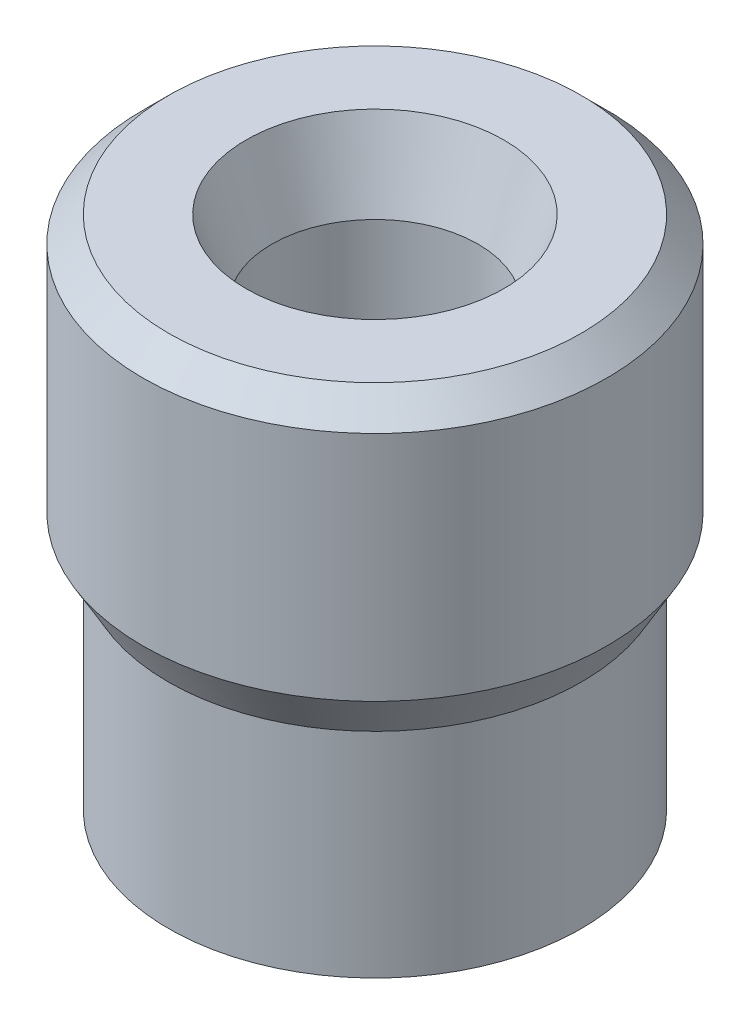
from build123d import *

# Parameters (mm, degrees)
SKICA1_R                 = 8
P_IDAT_VYSUNUT_M1_DEPTH  = 8.3
SKICA2_R                 = 9
P_IDAT_VYSUNUT_M2_DEPTH  = 11.7
ZKOSEN_1_SIZE            = 1.7
ZKOSEN_1_SIZE2           = 0.981495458
ZKOSEN_2_SIZE            = 1
SKICA3_R                 = 3
ODEBRAT_VYSUNUT_M1_DEPTH = 11
SKICA4_R                 = 4
ODEBRAT_VYSUNUT_M2_DEPTH = 9
ZKOSEN_3_SIZE            = 1
ZKOSEN_3_SIZE2           = 3


with BuildPart() as part:
    # Skica1 → P_idat vysunut_m1 (new body)
    with BuildSketch(Plane(origin=(0, 0, 0), x_dir=(1, 0, 0), z_dir=(0, 1, 0))):
        with Locations(Location((0, 0, 0), (0, 0, 90))):
            Circle(SKICA1_R)
    extrude(amount=P_IDAT_VYSUNUT_M1_DEPTH)

    # Skica2 → P_idat vysunut_m2 (add)
    with BuildSketch(Plane(origin=(0, 8.3, 0), x_dir=(-1, 0, 0), z_dir=(0, 1, 0))):
        with Locations(Location((0, 0, 0), (0, 0, 90))):
            Circle(SKICA2_R)
    extrude(amount=P_IDAT_VYSUNUT_M2_DEPTH)

    # Zkosen_1
    zkosen_1_edges = [part.edges().sort_by_distance(p)[0] for p in [
        (0, 8.3, -9),
    ]]
    zkosen_1_side = [part.faces().sort_by_distance(p)[0] for p in [
        (0, 14.15, -9),
    ]]
    chamfer(zkosen_1_edges, length=ZKOSEN_1_SIZE, length2=ZKOSEN_1_SIZE2, reference=zkosen_1_side[0])

    # Zkosen_2
    zkosen_2_edges = [part.edges().sort_by_distance(p)[0] for p in [
        (0, 20, -9),
    ]]
    chamfer(zkosen_2_edges, length=ZKOSEN_2_SIZE)

    # Skica3 → Odebrat vysunut_m1 (cut)
    with BuildSketch(Plane.XZ):
        with Locations(Location((0, 0, 0), (0, 0, 270))):
            Circle(SKICA3_R)
    extrude(amount=-ODEBRAT_VYSUNUT_M1_DEPTH, mode=Mode.SUBTRACT)

    # Skica4 → Odebrat vysunut_m2 (cut)
    with BuildSketch(Plane(origin=(0, 20, 0), x_dir=(1, 0, 0), z_dir=(0, 1, 0))):
        with Locations(Location((0, 0, 0), (0, 0, 270))):
            Circle(SKICA4_R)
    extrude(amount=-ODEBRAT_VYSUNUT_M2_DEPTH, mode=Mode.SUBTRACT)

    # Zkosen_3
    zkosen_3_edges = [part.edges().sort_by_distance(p)[0] for p in [
        (0, 20, -4),
    ]]
    zkosen_3_side = [part.faces().sort_by_distance(p)[0] for p in [
        (0, 20, -7.77372583),
    ]]
    chamfer(zkosen_3_edges, length=ZKOSEN_3_SIZE, length2=ZKOSEN_3_SIZE2, reference=zkosen_3_side[0])


solid = part.part
